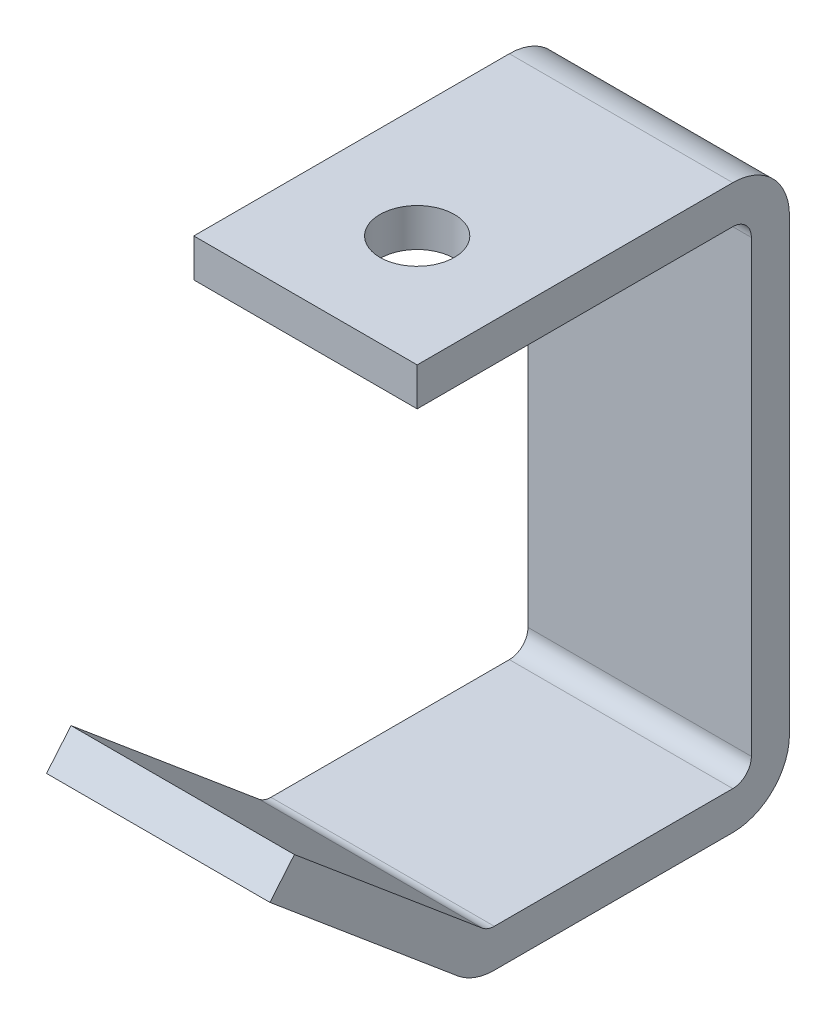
ISO-10303-21;
HEADER;
FILE_DESCRIPTION(('STEP AP214'),'2;1');
FILE_NAME('part.step','',(''),(''),'','','');
FILE_SCHEMA(('AUTOMOTIVE_DESIGN { 1 0 10303 214 1 1 1 1 }'));
ENDSEC;
DATA;
#1=APPLICATION_CONTEXT('core data for automotive mechanical design processes');
#2=APPLICATION_PROTOCOL_DEFINITION('international standard','automotive_design',2000,#1);
#3=PRODUCT_CONTEXT('',#1,'mechanical');
#4=PRODUCT('Part','Part','',(#3));
#5=PRODUCT_RELATED_PRODUCT_CATEGORY('part','',(#4));
#6=PRODUCT_DEFINITION_FORMATION('','',#4);
#7=PRODUCT_DEFINITION_CONTEXT('part definition',#1,'design');
#8=PRODUCT_DEFINITION('design','',#6,#7);
#9=PRODUCT_DEFINITION_SHAPE('','',#8);
#10=(LENGTH_UNIT() NAMED_UNIT(*) SI_UNIT(.MILLI.,.METRE.));
#11=(NAMED_UNIT(*) PLANE_ANGLE_UNIT() SI_UNIT($,.RADIAN.));
#12=(NAMED_UNIT(*) SI_UNIT($,.STERADIAN.) SOLID_ANGLE_UNIT());
#13=UNCERTAINTY_MEASURE_WITH_UNIT(LENGTH_MEASURE(1.E-05),#10,'distance_accuracy_value','');
#14=(GEOMETRIC_REPRESENTATION_CONTEXT(3) GLOBAL_UNCERTAINTY_ASSIGNED_CONTEXT((#13)) GLOBAL_UNIT_ASSIGNED_CONTEXT((#10,
#11,#12)) REPRESENTATION_CONTEXT('',''));
#15=CARTESIAN_POINT('',(0.,0.,0.));
#16=DIRECTION('',(0.,0.,1.));
#17=DIRECTION('',(1.,0.,0.));
#18=AXIS2_PLACEMENT_3D('',#15,#16,#17);
#19=CARTESIAN_POINT('',(19.05,89.5,3.175));
#20=DIRECTION('',(0.,-1.,0.));
#21=DIRECTION('',(0.,0.,-1.));
#22=AXIS2_PLACEMENT_3D('',#19,#20,#21);
#23=PLANE('',#22);
#24=CARTESIAN_POINT('',(0.,89.5,37.95));
#25=DIRECTION('',(0.,1.,0.));
#26=DIRECTION('',(0.,0.,1.));
#27=AXIS2_PLACEMENT_3D('',#24,#25,#26);
#28=CIRCLE('',#27,6.35);
#29=CARTESIAN_POINT('',(0.,89.5,44.3));
#30=VERTEX_POINT('',#29);
#31=EDGE_CURVE('E184',#30,#30,#28,.T.);
#32=ORIENTED_EDGE('',*,*,#31,.F.);
#33=EDGE_LOOP('',(#32));
#34=FACE_BOUND('',#33,.T.);
#35=DIRECTION('',(0.,0.,1.));
#36=VECTOR('',#35,1.);
#37=CARTESIAN_POINT('',(-19.05,89.5,3.175));
#38=LINE('',#37,#36);
#39=CARTESIAN_POINT('',(-19.05,89.5,3.175));
#40=VERTEX_POINT('',#39);
#41=CARTESIAN_POINT('',(-19.05,89.5,57.));
#42=VERTEX_POINT('',#41);
#43=EDGE_CURVE('E180',#40,#42,#38,.T.);
#44=ORIENTED_EDGE('',*,*,#43,.T.);
#45=DIRECTION('',(-1.,0.,0.));
#46=VECTOR('',#45,1.);
#47=CARTESIAN_POINT('',(19.05,89.5,57.));
#48=LINE('',#47,#46);
#49=CARTESIAN_POINT('',(19.05,89.5,57.));
#50=VERTEX_POINT('',#49);
#51=EDGE_CURVE('E11',#50,#42,#48,.T.);
#52=ORIENTED_EDGE('',*,*,#51,.F.);
#53=DIRECTION('',(0.,0.,1.));
#54=VECTOR('',#53,1.);
#55=CARTESIAN_POINT('',(19.05,89.5,3.175));
#56=LINE('',#55,#54);
#57=CARTESIAN_POINT('',(19.05,89.5,3.175));
#58=VERTEX_POINT('',#57);
#59=EDGE_CURVE('E117',#58,#50,#56,.T.);
#60=ORIENTED_EDGE('',*,*,#59,.F.);
#61=DIRECTION('',(-1.,0.,0.));
#62=VECTOR('',#61,1.);
#63=CARTESIAN_POINT('',(19.05,89.5,3.175));
#64=LINE('',#63,#62);
#65=EDGE_CURVE('E176',#58,#40,#64,.T.);
#66=ORIENTED_EDGE('',*,*,#65,.T.);
#67=EDGE_LOOP('',(#44,#52,#60,#66));
#68=FACE_BOUND('',#67,.T.);
#69=ADVANCED_FACE('F37',(#34,#68),#23,.F.);
#70=CARTESIAN_POINT('',(19.05,83.,57.));
#71=DIRECTION('',(0.,0.,1.));
#72=DIRECTION('',(0.,-1.,0.));
#73=AXIS2_PLACEMENT_3D('',#70,#71,#72);
#74=PLANE('',#73);
#75=DIRECTION('',(0.,1.,0.));
#76=VECTOR('',#75,1.);
#77=CARTESIAN_POINT('',(-19.05,83.,57.));
#78=LINE('',#77,#76);
#79=CARTESIAN_POINT('',(-19.05,83.,57.));
#80=VERTEX_POINT('',#79);
#81=EDGE_CURVE('E183',#80,#42,#78,.T.);
#82=ORIENTED_EDGE('',*,*,#81,.F.);
#83=DIRECTION('',(-1.,0.,0.));
#84=VECTOR('',#83,1.);
#85=CARTESIAN_POINT('',(19.05,83.,57.));
#86=LINE('',#85,#84);
#87=CARTESIAN_POINT('',(19.05,83.,57.));
#88=VERTEX_POINT('',#87);
#89=EDGE_CURVE('E45',#88,#80,#86,.T.);
#90=ORIENTED_EDGE('',*,*,#89,.F.);
#91=DIRECTION('',(0.,1.,0.));
#92=VECTOR('',#91,1.);
#93=CARTESIAN_POINT('',(19.05,83.,57.));
#94=LINE('',#93,#92);
#95=EDGE_CURVE('E266',#88,#50,#94,.T.);
#96=ORIENTED_EDGE('',*,*,#95,.T.);
#97=ORIENTED_EDGE('',*,*,#51,.T.);
#98=EDGE_LOOP('',(#82,#90,#96,#97));
#99=FACE_BOUND('',#98,.T.);
#100=ADVANCED_FACE('F253',(#99),#74,.T.);
#101=CARTESIAN_POINT('',(19.05,83.,3.175));
#102=DIRECTION('',(0.,-1.,0.));
#103=DIRECTION('',(0.,0.,-1.));
#104=AXIS2_PLACEMENT_3D('',#101,#102,#103);
#105=PLANE('',#104);
#106=CARTESIAN_POINT('',(0.,83.,37.95));
#107=DIRECTION('',(0.,-1.,0.));
#108=DIRECTION('',(0.,0.,-1.));
#109=AXIS2_PLACEMENT_3D('',#106,#107,#108);
#110=CIRCLE('',#109,6.35);
#111=CARTESIAN_POINT('',(0.,83.,44.3));
#112=VERTEX_POINT('',#111);
#113=EDGE_CURVE('E324',#112,#112,#110,.F.);
#114=ORIENTED_EDGE('',*,*,#113,.T.);
#115=EDGE_LOOP('',(#114));
#116=FACE_BOUND('',#115,.T.);
#117=DIRECTION('',(0.,0.,1.));
#118=VECTOR('',#117,1.);
#119=CARTESIAN_POINT('',(-19.05,83.,3.175));
#120=LINE('',#119,#118);
#121=CARTESIAN_POINT('',(-19.05,83.,3.175));
#122=VERTEX_POINT('',#121);
#123=EDGE_CURVE('E187',#122,#80,#120,.T.);
#124=ORIENTED_EDGE('',*,*,#123,.F.);
#125=DIRECTION('',(-1.,0.,0.));
#126=VECTOR('',#125,1.);
#127=CARTESIAN_POINT('',(19.05,83.,3.175));
#128=LINE('',#127,#126);
#129=CARTESIAN_POINT('',(19.05,83.,3.175));
#130=VERTEX_POINT('',#129);
#131=EDGE_CURVE('E243',#130,#122,#128,.T.);
#132=ORIENTED_EDGE('',*,*,#131,.F.);
#133=DIRECTION('',(0.,0.,1.));
#134=VECTOR('',#133,1.);
#135=CARTESIAN_POINT('',(19.05,83.,3.175));
#136=LINE('',#135,#134);
#137=EDGE_CURVE('E250',#130,#88,#136,.T.);
#138=ORIENTED_EDGE('',*,*,#137,.T.);
#139=ORIENTED_EDGE('',*,*,#89,.T.);
#140=EDGE_LOOP('',(#124,#132,#138,#139));
#141=FACE_BOUND('',#140,.T.);
#142=ADVANCED_FACE('F248',(#116,#141),#105,.T.);
#143=CARTESIAN_POINT('',(19.05,79.825,3.175));
#144=DIRECTION('',(-1.,0.,0.));
#145=DIRECTION('',(0.,0.,1.));
#146=AXIS2_PLACEMENT_3D('',#143,#144,#145);
#147=CYLINDRICAL_SURFACE('',#146,3.175);
#148=CARTESIAN_POINT('',(-19.05,79.825,3.175));
#149=DIRECTION('',(1.,0.,0.));
#150=DIRECTION('',(0.,0.,-1.));
#151=AXIS2_PLACEMENT_3D('',#148,#149,#150);
#152=CIRCLE('',#151,3.175);
#153=CARTESIAN_POINT('',(-19.05,79.825,0.));
#154=VERTEX_POINT('',#153);
#155=EDGE_CURVE('E190',#154,#122,#152,.T.);
#156=ORIENTED_EDGE('',*,*,#155,.F.);
#157=DIRECTION('',(-1.,0.,0.));
#158=VECTOR('',#157,1.);
#159=CARTESIAN_POINT('',(19.05,79.825,0.));
#160=LINE('',#159,#158);
#161=CARTESIAN_POINT('',(19.05,79.825,0.));
#162=VERTEX_POINT('',#161);
#163=EDGE_CURVE('E241',#162,#154,#160,.T.);
#164=ORIENTED_EDGE('',*,*,#163,.F.);
#165=CARTESIAN_POINT('',(19.05,79.825,3.175));
#166=DIRECTION('',(1.,0.,0.));
#167=DIRECTION('',(0.,0.,-1.));
#168=AXIS2_PLACEMENT_3D('',#165,#166,#167);
#169=CIRCLE('',#168,3.175);
#170=EDGE_CURVE('E263',#162,#130,#169,.T.);
#171=ORIENTED_EDGE('',*,*,#170,.T.);
#172=ORIENTED_EDGE('',*,*,#131,.T.);
#173=EDGE_LOOP('',(#156,#164,#171,#172));
#174=FACE_BOUND('',#173,.T.);
#175=ADVANCED_FACE('F260',(#174),#147,.F.);
#176=CARTESIAN_POINT('',(19.05,3.175,0.));
#177=DIRECTION('',(0.,0.,1.));
#178=DIRECTION('',(1.,0.,0.));
#179=AXIS2_PLACEMENT_3D('',#176,#177,#178);
#180=PLANE('',#179);
#181=DIRECTION('',(0.,1.,0.));
#182=VECTOR('',#181,1.);
#183=CARTESIAN_POINT('',(-19.05,3.175,0.));
#184=LINE('',#183,#182);
#185=CARTESIAN_POINT('',(-19.05,3.175,0.));
#186=VERTEX_POINT('',#185);
#187=EDGE_CURVE('E193',#186,#154,#184,.T.);
#188=ORIENTED_EDGE('',*,*,#187,.F.);
#189=DIRECTION('',(-1.,0.,0.));
#190=VECTOR('',#189,1.);
#191=CARTESIAN_POINT('',(19.05,3.175,0.));
#192=LINE('',#191,#190);
#193=CARTESIAN_POINT('',(19.05,3.175,0.));
#194=VERTEX_POINT('',#193);
#195=EDGE_CURVE('E239',#194,#186,#192,.T.);
#196=ORIENTED_EDGE('',*,*,#195,.F.);
#197=DIRECTION('',(0.,1.,0.));
#198=VECTOR('',#197,1.);
#199=CARTESIAN_POINT('',(19.05,3.175,0.));
#200=LINE('',#199,#198);
#201=EDGE_CURVE('E268',#194,#162,#200,.T.);
#202=ORIENTED_EDGE('',*,*,#201,.T.);
#203=ORIENTED_EDGE('',*,*,#163,.T.);
#204=EDGE_LOOP('',(#188,#196,#202,#203));
#205=FACE_BOUND('',#204,.T.);
#206=ADVANCED_FACE('F414',(#205),#180,.T.);
#207=CARTESIAN_POINT('',(19.05,3.175,3.175));
#208=DIRECTION('',(-1.,0.,0.));
#209=DIRECTION('',(0.,0.,1.));
#210=AXIS2_PLACEMENT_3D('',#207,#208,#209);
#211=CYLINDRICAL_SURFACE('',#210,3.175);
#212=CARTESIAN_POINT('',(-19.05,3.175,3.175));
#213=DIRECTION('',(1.,0.,0.));
#214=DIRECTION('',(0.,0.,1.));
#215=AXIS2_PLACEMENT_3D('',#212,#213,#214);
#216=CIRCLE('',#215,3.175);
#217=CARTESIAN_POINT('',(-19.05,0.,3.175));
#218=VERTEX_POINT('',#217);
#219=EDGE_CURVE('E196',#218,#186,#216,.T.);
#220=ORIENTED_EDGE('',*,*,#219,.F.);
#221=DIRECTION('',(-1.,0.,0.));
#222=VECTOR('',#221,1.);
#223=CARTESIAN_POINT('',(19.05,0.,3.175));
#224=LINE('',#223,#222);
#225=CARTESIAN_POINT('',(19.05,0.,3.175));
#226=VERTEX_POINT('',#225);
#227=EDGE_CURVE('E237',#226,#218,#224,.T.);
#228=ORIENTED_EDGE('',*,*,#227,.F.);
#229=CARTESIAN_POINT('',(19.05,3.175,3.175));
#230=DIRECTION('',(1.,0.,0.));
#231=DIRECTION('',(0.,0.,1.));
#232=AXIS2_PLACEMENT_3D('',#229,#230,#231);
#233=CIRCLE('',#232,3.175);
#234=EDGE_CURVE('E274',#226,#194,#233,.T.);
#235=ORIENTED_EDGE('',*,*,#234,.T.);
#236=ORIENTED_EDGE('',*,*,#195,.T.);
#237=EDGE_LOOP('',(#220,#228,#235,#236));
#238=FACE_BOUND('',#237,.T.);
#239=ADVANCED_FACE('F406',(#238),#211,.F.);
#240=CARTESIAN_POINT('',(19.05,0.,43.8443945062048));
#241=DIRECTION('',(0.,1.,0.));
#242=DIRECTION('',(0.,0.,1.));
#243=AXIS2_PLACEMENT_3D('',#240,#241,#242);
#244=PLANE('',#243);
#245=DIRECTION('',(0.,0.,-1.));
#246=VECTOR('',#245,1.);
#247=CARTESIAN_POINT('',(-19.05,0.,43.8443945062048));
#248=LINE('',#247,#246);
#249=CARTESIAN_POINT('',(-19.05,0.,43.8443945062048));
#250=VERTEX_POINT('',#249);
#251=EDGE_CURVE('E199',#250,#218,#248,.T.);
#252=ORIENTED_EDGE('',*,*,#251,.F.);
#253=DIRECTION('',(-1.,0.,0.));
#254=VECTOR('',#253,1.);
#255=CARTESIAN_POINT('',(19.05,0.,43.8443945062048));
#256=LINE('',#255,#254);
#257=CARTESIAN_POINT('',(19.05,0.,43.8443945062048));
#258=VERTEX_POINT('',#257);
#259=EDGE_CURVE('E235',#258,#250,#256,.T.);
#260=ORIENTED_EDGE('',*,*,#259,.F.);
#261=DIRECTION('',(0.,0.,-1.));
#262=VECTOR('',#261,1.);
#263=CARTESIAN_POINT('',(19.05,0.,43.8443945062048));
#264=LINE('',#263,#262);
#265=EDGE_CURVE('E277',#258,#226,#264,.T.);
#266=ORIENTED_EDGE('',*,*,#265,.T.);
#267=ORIENTED_EDGE('',*,*,#227,.T.);
#268=EDGE_LOOP('',(#252,#260,#266,#267));
#269=FACE_BOUND('',#268,.T.);
#270=ADVANCED_FACE('F398',(#269),#244,.T.);
#271=CARTESIAN_POINT('',(19.05,3.175,43.8443945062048));
#272=DIRECTION('',(-1.,0.,0.));
#273=DIRECTION('',(0.,0.,1.));
#274=AXIS2_PLACEMENT_3D('',#271,#272,#273);
#275=CYLINDRICAL_SURFACE('',#274,3.175);
#276=CARTESIAN_POINT('',(-19.05,3.175,43.8443945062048));
#277=DIRECTION('',(1.,0.,0.));
#278=DIRECTION('',(0.,0.,-1.));
#279=AXIS2_PLACEMENT_3D('',#276,#277,#278);
#280=CIRCLE('',#279,3.175);
#281=CARTESIAN_POINT('',(-19.05,0.742808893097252,45.8852451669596));
#282=VERTEX_POINT('',#281);
#283=EDGE_CURVE('E202',#282,#250,#280,.T.);
#284=ORIENTED_EDGE('',*,*,#283,.F.);
#285=DIRECTION('',(-1.,0.,0.));
#286=VECTOR('',#285,1.);
#287=CARTESIAN_POINT('',(19.05,0.742808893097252,45.8852451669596));
#288=LINE('',#287,#286);
#289=CARTESIAN_POINT('',(19.05,0.742808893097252,45.8852451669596));
#290=VERTEX_POINT('',#289);
#291=EDGE_CURVE('E233',#290,#282,#288,.T.);
#292=ORIENTED_EDGE('',*,*,#291,.F.);
#293=CARTESIAN_POINT('',(19.05,3.175,43.8443945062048));
#294=DIRECTION('',(1.,0.,0.));
#295=DIRECTION('',(0.,0.,-1.));
#296=AXIS2_PLACEMENT_3D('',#293,#294,#295);
#297=CIRCLE('',#296,3.175);
#298=EDGE_CURVE('E280',#290,#258,#297,.T.);
#299=ORIENTED_EDGE('',*,*,#298,.T.);
#300=ORIENTED_EDGE('',*,*,#259,.T.);
#301=EDGE_LOOP('',(#284,#292,#299,#300));
#302=FACE_BOUND('',#301,.T.);
#303=ADVANCED_FACE('F390',(#302),#275,.F.);
#304=CARTESIAN_POINT('',(19.05,27.6398672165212,77.939911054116));
#305=DIRECTION('',(0.,0.766044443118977,-0.642787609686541));
#306=DIRECTION('',(0.,0.642787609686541,0.766044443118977));
#307=AXIS2_PLACEMENT_3D('',#304,#305,#306);
#308=PLANE('',#307);
#309=DIRECTION('',(0.,-0.642787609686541,-0.766044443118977));
#310=VECTOR('',#309,1.);
#311=CARTESIAN_POINT('',(-19.05,27.6398672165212,77.939911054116));
#312=LINE('',#311,#310);
#313=CARTESIAN_POINT('',(-19.05,27.6398672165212,77.939911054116));
#314=VERTEX_POINT('',#313);
#315=EDGE_CURVE('E205',#314,#282,#312,.T.);
#316=ORIENTED_EDGE('',*,*,#315,.F.);
#317=DIRECTION('',(-1.,0.,0.));
#318=VECTOR('',#317,1.);
#319=CARTESIAN_POINT('',(19.05,27.6398672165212,77.939911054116));
#320=LINE('',#319,#318);
#321=CARTESIAN_POINT('',(19.05,27.6398672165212,77.939911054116));
#322=VERTEX_POINT('',#321);
#323=EDGE_CURVE('E231',#322,#314,#320,.T.);
#324=ORIENTED_EDGE('',*,*,#323,.F.);
#325=DIRECTION('',(0.,-0.642787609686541,-0.766044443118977));
#326=VECTOR('',#325,1.);
#327=CARTESIAN_POINT('',(19.05,27.6398672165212,77.939911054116));
#328=LINE('',#327,#326);
#329=EDGE_CURVE('E283',#322,#290,#328,.T.);
#330=ORIENTED_EDGE('',*,*,#329,.T.);
#331=ORIENTED_EDGE('',*,*,#291,.T.);
#332=EDGE_LOOP('',(#316,#324,#330,#331));
#333=FACE_BOUND('',#332,.T.);
#334=ADVANCED_FACE('F382',(#333),#308,.T.);
#335=CARTESIAN_POINT('',(19.05,22.6605783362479,82.1180305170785));
#336=DIRECTION('',(0.,0.64278760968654,0.766044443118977));
#337=DIRECTION('',(0.,-0.766044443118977,0.64278760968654));
#338=AXIS2_PLACEMENT_3D('',#335,#336,#337);
#339=PLANE('',#338);
#340=DIRECTION('',(0.,0.766044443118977,-0.64278760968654));
#341=VECTOR('',#340,1.);
#342=CARTESIAN_POINT('',(-19.05,22.6605783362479,82.1180305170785));
#343=LINE('',#342,#341);
#344=CARTESIAN_POINT('',(-19.05,22.6605783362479,82.1180305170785));
#345=VERTEX_POINT('',#344);
#346=EDGE_CURVE('E208',#345,#314,#343,.T.);
#347=ORIENTED_EDGE('',*,*,#346,.F.);
#348=DIRECTION('',(-1.,0.,0.));
#349=VECTOR('',#348,1.);
#350=CARTESIAN_POINT('',(19.05,22.6605783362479,82.1180305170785));
#351=LINE('',#350,#349);
#352=CARTESIAN_POINT('',(19.05,22.6605783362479,82.1180305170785));
#353=VERTEX_POINT('',#352);
#354=EDGE_CURVE('E229',#353,#345,#351,.T.);
#355=ORIENTED_EDGE('',*,*,#354,.F.);
#356=DIRECTION('',(0.,0.766044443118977,-0.64278760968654));
#357=VECTOR('',#356,1.);
#358=CARTESIAN_POINT('',(19.05,22.6605783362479,82.1180305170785));
#359=LINE('',#358,#357);
#360=EDGE_CURVE('E286',#353,#322,#359,.T.);
#361=ORIENTED_EDGE('',*,*,#360,.T.);
#362=ORIENTED_EDGE('',*,*,#323,.T.);
#363=EDGE_LOOP('',(#347,#355,#361,#362));
#364=FACE_BOUND('',#363,.T.);
#365=ADVANCED_FACE('F374',(#364),#339,.T.);
#366=CARTESIAN_POINT('',(19.05,22.6605783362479,82.1180305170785));
#367=DIRECTION('',(0.,0.766044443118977,-0.642787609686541));
#368=DIRECTION('',(0.,0.642787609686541,0.766044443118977));
#369=AXIS2_PLACEMENT_3D('',#366,#367,#368);
#370=PLANE('',#369);
#371=DIRECTION('',(0.,-0.642787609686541,-0.766044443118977));
#372=VECTOR('',#371,1.);
#373=CARTESIAN_POINT('',(-19.05,22.6605783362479,82.1180305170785));
#374=LINE('',#373,#372);
#375=CARTESIAN_POINT('',(-19.05,-4.23647998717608,50.0633646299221));
#376=VERTEX_POINT('',#375);
#377=EDGE_CURVE('E211',#345,#376,#374,.T.);
#378=ORIENTED_EDGE('',*,*,#377,.T.);
#379=DIRECTION('',(-1.,0.,0.));
#380=VECTOR('',#379,1.);
#381=CARTESIAN_POINT('',(19.05,-4.23647998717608,50.0633646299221));
#382=LINE('',#381,#380);
#383=CARTESIAN_POINT('',(19.05,-4.23647998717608,50.0633646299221));
#384=VERTEX_POINT('',#383);
#385=EDGE_CURVE('E226',#384,#376,#382,.T.);
#386=ORIENTED_EDGE('',*,*,#385,.F.);
#387=DIRECTION('',(0.,-0.642787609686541,-0.766044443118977));
#388=VECTOR('',#387,1.);
#389=CARTESIAN_POINT('',(19.05,22.6605783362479,82.1180305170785));
#390=LINE('',#389,#388);
#391=EDGE_CURVE('E289',#353,#384,#390,.T.);
#392=ORIENTED_EDGE('',*,*,#391,.F.);
#393=ORIENTED_EDGE('',*,*,#354,.T.);
#394=EDGE_LOOP('',(#378,#386,#392,#393));
#395=FACE_BOUND('',#394,.T.);
#396=ADVANCED_FACE('F367',(#395),#370,.F.);
#397=CARTESIAN_POINT('',(19.05,3.175,43.8443945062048));
#398=DIRECTION('',(-1.,0.,0.));
#399=DIRECTION('',(0.,0.,1.));
#400=AXIS2_PLACEMENT_3D('',#397,#398,#399);
#401=CYLINDRICAL_SURFACE('',#400,9.675);
#402=CARTESIAN_POINT('',(-19.05,3.175,43.8443945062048));
#403=DIRECTION('',(1.,0.,0.));
#404=DIRECTION('',(0.,0.,-1.));
#405=AXIS2_PLACEMENT_3D('',#402,#403,#404);
#406=CIRCLE('',#405,9.675);
#407=CARTESIAN_POINT('',(-19.05,-6.5,43.8443945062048));
#408=VERTEX_POINT('',#407);
#409=EDGE_CURVE('E213',#376,#408,#406,.T.);
#410=ORIENTED_EDGE('',*,*,#409,.T.);
#411=DIRECTION('',(-1.,0.,0.));
#412=VECTOR('',#411,1.);
#413=CARTESIAN_POINT('',(19.05,-6.5,43.8443945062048));
#414=LINE('',#413,#412);
#415=CARTESIAN_POINT('',(19.05,-6.5,43.8443945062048));
#416=VERTEX_POINT('',#415);
#417=EDGE_CURVE('E223',#416,#408,#414,.T.);
#418=ORIENTED_EDGE('',*,*,#417,.F.);
#419=CARTESIAN_POINT('',(19.05,3.175,43.8443945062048));
#420=DIRECTION('',(1.,0.,0.));
#421=DIRECTION('',(0.,0.,-1.));
#422=AXIS2_PLACEMENT_3D('',#419,#420,#421);
#423=CIRCLE('',#422,9.675);
#424=EDGE_CURVE('E291',#384,#416,#423,.T.);
#425=ORIENTED_EDGE('',*,*,#424,.F.);
#426=ORIENTED_EDGE('',*,*,#385,.T.);
#427=EDGE_LOOP('',(#410,#418,#425,#426));
#428=FACE_BOUND('',#427,.T.);
#429=ADVANCED_FACE('F298',(#428),#401,.T.);
#430=CARTESIAN_POINT('',(19.05,-6.5,43.8443945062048));
#431=DIRECTION('',(0.,1.,0.));
#432=DIRECTION('',(0.,0.,1.));
#433=AXIS2_PLACEMENT_3D('',#430,#431,#432);
#434=PLANE('',#433);
#435=DIRECTION('',(0.,0.,-1.));
#436=VECTOR('',#435,1.);
#437=CARTESIAN_POINT('',(-19.05,-6.5,43.8443945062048));
#438=LINE('',#437,#436);
#439=CARTESIAN_POINT('',(-19.05,-6.5,3.17499999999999));
#440=VERTEX_POINT('',#439);
#441=EDGE_CURVE('E215',#408,#440,#438,.T.);
#442=ORIENTED_EDGE('',*,*,#441,.T.);
#443=DIRECTION('',(-1.,0.,0.));
#444=VECTOR('',#443,1.);
#445=CARTESIAN_POINT('',(19.05,-6.5,3.17499999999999));
#446=LINE('',#445,#444);
#447=CARTESIAN_POINT('',(19.05,-6.5,3.17499999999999));
#448=VERTEX_POINT('',#447);
#449=EDGE_CURVE('E171',#448,#440,#446,.T.);
#450=ORIENTED_EDGE('',*,*,#449,.F.);
#451=DIRECTION('',(0.,0.,-1.));
#452=VECTOR('',#451,1.);
#453=CARTESIAN_POINT('',(19.05,-6.5,43.8443945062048));
#454=LINE('',#453,#452);
#455=EDGE_CURVE('E162',#416,#448,#454,.T.);
#456=ORIENTED_EDGE('',*,*,#455,.F.);
#457=ORIENTED_EDGE('',*,*,#417,.T.);
#458=EDGE_LOOP('',(#442,#450,#456,#457));
#459=FACE_BOUND('',#458,.T.);
#460=ADVANCED_FACE('F302',(#459),#434,.F.);
#461=CARTESIAN_POINT('',(19.05,3.175,3.175));
#462=DIRECTION('',(-1.,0.,0.));
#463=DIRECTION('',(0.,0.,1.));
#464=AXIS2_PLACEMENT_3D('',#461,#462,#463);
#465=CYLINDRICAL_SURFACE('',#464,9.675);
#466=CARTESIAN_POINT('',(-19.05,3.175,3.175));
#467=DIRECTION('',(1.,0.,0.));
#468=DIRECTION('',(0.,0.,-1.));
#469=AXIS2_PLACEMENT_3D('',#466,#467,#468);
#470=CIRCLE('',#469,9.675);
#471=CARTESIAN_POINT('',(-19.05,3.175,-6.5));
#472=VERTEX_POINT('',#471);
#473=EDGE_CURVE('E170',#440,#472,#470,.T.);
#474=ORIENTED_EDGE('',*,*,#473,.T.);
#475=DIRECTION('',(-1.,0.,0.));
#476=VECTOR('',#475,1.);
#477=CARTESIAN_POINT('',(19.05,3.175,-6.5));
#478=LINE('',#477,#476);
#479=CARTESIAN_POINT('',(19.05,3.175,-6.5));
#480=VERTEX_POINT('',#479);
#481=EDGE_CURVE('E167',#480,#472,#478,.T.);
#482=ORIENTED_EDGE('',*,*,#481,.F.);
#483=CARTESIAN_POINT('',(19.05,3.175,3.175));
#484=DIRECTION('',(1.,0.,0.));
#485=DIRECTION('',(0.,0.,-1.));
#486=AXIS2_PLACEMENT_3D('',#483,#484,#485);
#487=CIRCLE('',#486,9.675);
#488=EDGE_CURVE('E156',#448,#480,#487,.T.);
#489=ORIENTED_EDGE('',*,*,#488,.F.);
#490=ORIENTED_EDGE('',*,*,#449,.T.);
#491=EDGE_LOOP('',(#474,#482,#489,#490));
#492=FACE_BOUND('',#491,.T.);
#493=ADVANCED_FACE('F168',(#492),#465,.T.);
#494=CARTESIAN_POINT('',(19.05,3.175,-6.5));
#495=DIRECTION('',(0.,0.,1.));
#496=DIRECTION('',(1.,0.,0.));
#497=AXIS2_PLACEMENT_3D('',#494,#495,#496);
#498=PLANE('',#497);
#499=DIRECTION('',(0.,1.,0.));
#500=VECTOR('',#499,1.);
#501=CARTESIAN_POINT('',(-19.05,3.175,-6.5));
#502=LINE('',#501,#500);
#503=CARTESIAN_POINT('',(-19.05,79.825,-6.5));
#504=VERTEX_POINT('',#503);
#505=EDGE_CURVE('E105',#472,#504,#502,.T.);
#506=ORIENTED_EDGE('',*,*,#505,.T.);
#507=DIRECTION('',(-1.,0.,0.));
#508=VECTOR('',#507,1.);
#509=CARTESIAN_POINT('',(19.05,79.825,-6.5));
#510=LINE('',#509,#508);
#511=CARTESIAN_POINT('',(19.05,79.825,-6.5));
#512=VERTEX_POINT('',#511);
#513=EDGE_CURVE('E172',#512,#504,#510,.T.);
#514=ORIENTED_EDGE('',*,*,#513,.F.);
#515=DIRECTION('',(0.,1.,0.));
#516=VECTOR('',#515,1.);
#517=CARTESIAN_POINT('',(19.05,3.175,-6.5));
#518=LINE('',#517,#516);
#519=EDGE_CURVE('E160',#480,#512,#518,.T.);
#520=ORIENTED_EDGE('',*,*,#519,.F.);
#521=ORIENTED_EDGE('',*,*,#481,.T.);
#522=EDGE_LOOP('',(#506,#514,#520,#521));
#523=FACE_BOUND('',#522,.T.);
#524=ADVANCED_FACE('F174',(#523),#498,.F.);
#525=CARTESIAN_POINT('',(19.05,79.825,3.175));
#526=DIRECTION('',(-1.,0.,0.));
#527=DIRECTION('',(0.,0.,1.));
#528=AXIS2_PLACEMENT_3D('',#525,#526,#527);
#529=CYLINDRICAL_SURFACE('',#528,9.675);
#530=CARTESIAN_POINT('',(-19.05,79.825,3.175));
#531=DIRECTION('',(1.,0.,0.));
#532=DIRECTION('',(0.,0.,-1.));
#533=AXIS2_PLACEMENT_3D('',#530,#531,#532);
#534=CIRCLE('',#533,9.675);
#535=EDGE_CURVE('E111',#504,#40,#534,.T.);
#536=ORIENTED_EDGE('',*,*,#535,.T.);
#537=ORIENTED_EDGE('',*,*,#65,.F.);
#538=CARTESIAN_POINT('',(19.05,79.825,3.175));
#539=DIRECTION('',(1.,0.,0.));
#540=DIRECTION('',(0.,0.,-1.));
#541=AXIS2_PLACEMENT_3D('',#538,#539,#540);
#542=CIRCLE('',#541,9.675);
#543=EDGE_CURVE('E53',#512,#58,#542,.T.);
#544=ORIENTED_EDGE('',*,*,#543,.F.);
#545=ORIENTED_EDGE('',*,*,#513,.T.);
#546=EDGE_LOOP('',(#536,#537,#544,#545));
#547=FACE_BOUND('',#546,.T.);
#548=ADVANCED_FACE('F304',(#547),#529,.T.);
#549=CARTESIAN_POINT('',(19.05,79.825,3.175));
#550=DIRECTION('',(1.,0.,0.));
#551=DIRECTION('',(0.,0.,-1.));
#552=AXIS2_PLACEMENT_3D('',#549,#550,#551);
#553=PLANE('',#552);
#554=ORIENTED_EDGE('',*,*,#59,.T.);
#555=ORIENTED_EDGE('',*,*,#95,.F.);
#556=ORIENTED_EDGE('',*,*,#137,.F.);
#557=ORIENTED_EDGE('',*,*,#170,.F.);
#558=ORIENTED_EDGE('',*,*,#201,.F.);
#559=ORIENTED_EDGE('',*,*,#234,.F.);
#560=ORIENTED_EDGE('',*,*,#265,.F.);
#561=ORIENTED_EDGE('',*,*,#298,.F.);
#562=ORIENTED_EDGE('',*,*,#329,.F.);
#563=ORIENTED_EDGE('',*,*,#360,.F.);
#564=ORIENTED_EDGE('',*,*,#391,.T.);
#565=ORIENTED_EDGE('',*,*,#424,.T.);
#566=ORIENTED_EDGE('',*,*,#455,.T.);
#567=ORIENTED_EDGE('',*,*,#488,.T.);
#568=ORIENTED_EDGE('',*,*,#519,.T.);
#569=ORIENTED_EDGE('',*,*,#543,.T.);
#570=EDGE_LOOP('',(#554,#555,#556,#557,#558,#559,#560,#561,#562,#563,#564,#565,#566,#567,#568,#569));
#571=FACE_BOUND('',#570,.T.);
#572=ADVANCED_FACE('F158',(#571),#553,.T.);
#573=CARTESIAN_POINT('',(-19.05,79.825,3.175));
#574=DIRECTION('',(1.,0.,0.));
#575=DIRECTION('',(0.,0.,-1.));
#576=AXIS2_PLACEMENT_3D('',#573,#574,#575);
#577=PLANE('',#576);
#578=ORIENTED_EDGE('',*,*,#43,.F.);
#579=ORIENTED_EDGE('',*,*,#535,.F.);
#580=ORIENTED_EDGE('',*,*,#505,.F.);
#581=ORIENTED_EDGE('',*,*,#473,.F.);
#582=ORIENTED_EDGE('',*,*,#441,.F.);
#583=ORIENTED_EDGE('',*,*,#409,.F.);
#584=ORIENTED_EDGE('',*,*,#377,.F.);
#585=ORIENTED_EDGE('',*,*,#346,.T.);
#586=ORIENTED_EDGE('',*,*,#315,.T.);
#587=ORIENTED_EDGE('',*,*,#283,.T.);
#588=ORIENTED_EDGE('',*,*,#251,.T.);
#589=ORIENTED_EDGE('',*,*,#219,.T.);
#590=ORIENTED_EDGE('',*,*,#187,.T.);
#591=ORIENTED_EDGE('',*,*,#155,.T.);
#592=ORIENTED_EDGE('',*,*,#123,.T.);
#593=ORIENTED_EDGE('',*,*,#81,.T.);
#594=EDGE_LOOP('',(#578,#579,#580,#581,#582,#583,#584,#585,#586,#587,#588,#589,#590,#591,#592,#593));
#595=FACE_BOUND('',#594,.T.);
#596=ADVANCED_FACE('F256',(#595),#577,.F.);
#597=CARTESIAN_POINT('',(0.,-6.50100000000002,37.9500000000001));
#598=DIRECTION('',(0.,1.,0.));
#599=DIRECTION('',(0.,0.,1.));
#600=AXIS2_PLACEMENT_3D('',#597,#598,#599);
#601=CYLINDRICAL_SURFACE('',#600,6.35);
#602=CARTESIAN_POINT('',(0.,83.,44.3));
#603=CARTESIAN_POINT('',(0.,83.0677083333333,44.3));
#604=CARTESIAN_POINT('',(0.,83.1354166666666,44.3));
#605=CARTESIAN_POINT('',(0.,83.2708333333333,44.3));
#606=CARTESIAN_POINT('',(0.,83.3385416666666,44.3));
#607=CARTESIAN_POINT('',(0.,83.4739583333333,44.3));
#608=CARTESIAN_POINT('',(0.,83.5416666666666,44.3));
#609=CARTESIAN_POINT('',(0.,83.6770833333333,44.3));
#610=CARTESIAN_POINT('',(0.,83.7447916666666,44.3));
#611=CARTESIAN_POINT('',(0.,83.8802083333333,44.3));
#612=CARTESIAN_POINT('',(0.,83.9479166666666,44.3));
#613=CARTESIAN_POINT('',(0.,84.0833333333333,44.3));
#614=CARTESIAN_POINT('',(0.,84.1510416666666,44.3));
#615=CARTESIAN_POINT('',(0.,84.2864583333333,44.3));
#616=CARTESIAN_POINT('',(0.,84.3541666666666,44.3));
#617=CARTESIAN_POINT('',(0.,84.4895833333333,44.3));
#618=CARTESIAN_POINT('',(0.,84.5572916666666,44.3));
#619=CARTESIAN_POINT('',(0.,84.6927083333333,44.3));
#620=CARTESIAN_POINT('',(0.,84.7604166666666,44.3));
#621=CARTESIAN_POINT('',(0.,84.8958333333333,44.3));
#622=CARTESIAN_POINT('',(0.,84.9635416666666,44.3));
#623=CARTESIAN_POINT('',(0.,85.0989583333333,44.3));
#624=CARTESIAN_POINT('',(0.,85.1666666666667,44.3));
#625=CARTESIAN_POINT('',(0.,85.3020833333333,44.3));
#626=CARTESIAN_POINT('',(0.,85.3697916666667,44.3));
#627=CARTESIAN_POINT('',(0.,85.5052083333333,44.3));
#628=CARTESIAN_POINT('',(0.,85.5729166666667,44.3));
#629=CARTESIAN_POINT('',(0.,85.7083333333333,44.3));
#630=CARTESIAN_POINT('',(0.,85.7760416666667,44.3));
#631=CARTESIAN_POINT('',(0.,85.9114583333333,44.3));
#632=CARTESIAN_POINT('',(0.,85.9791666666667,44.3));
#633=CARTESIAN_POINT('',(0.,86.1145833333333,44.3));
#634=CARTESIAN_POINT('',(0.,86.1822916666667,44.3));
#635=CARTESIAN_POINT('',(0.,86.3177083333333,44.3));
#636=CARTESIAN_POINT('',(0.,86.3854166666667,44.3));
#637=CARTESIAN_POINT('',(0.,86.5208333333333,44.3));
#638=CARTESIAN_POINT('',(0.,86.5885416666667,44.3));
#639=CARTESIAN_POINT('',(0.,86.7239583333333,44.3));
#640=CARTESIAN_POINT('',(0.,86.7916666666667,44.3));
#641=CARTESIAN_POINT('',(0.,86.9270833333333,44.3));
#642=CARTESIAN_POINT('',(0.,86.9947916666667,44.3));
#643=CARTESIAN_POINT('',(0.,87.1302083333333,44.3));
#644=CARTESIAN_POINT('',(0.,87.1979166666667,44.3));
#645=CARTESIAN_POINT('',(0.,87.3333333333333,44.3));
#646=CARTESIAN_POINT('',(0.,87.4010416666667,44.3));
#647=CARTESIAN_POINT('',(0.,87.5364583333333,44.3));
#648=CARTESIAN_POINT('',(0.,87.6041666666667,44.3));
#649=CARTESIAN_POINT('',(0.,87.7395833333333,44.3));
#650=CARTESIAN_POINT('',(0.,87.8072916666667,44.3));
#651=CARTESIAN_POINT('',(0.,87.9427083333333,44.3));
#652=CARTESIAN_POINT('',(0.,88.0104166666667,44.3));
#653=CARTESIAN_POINT('',(0.,88.1458333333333,44.3));
#654=CARTESIAN_POINT('',(0.,88.2135416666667,44.3));
#655=CARTESIAN_POINT('',(0.,88.3489583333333,44.3));
#656=CARTESIAN_POINT('',(0.,88.4166666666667,44.3));
#657=CARTESIAN_POINT('',(0.,88.5520833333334,44.3));
#658=CARTESIAN_POINT('',(0.,88.6197916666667,44.3));
#659=CARTESIAN_POINT('',(0.,88.7552083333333,44.3));
#660=CARTESIAN_POINT('',(0.,88.8229166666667,44.3));
#661=CARTESIAN_POINT('',(0.,88.9583333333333,44.3));
#662=CARTESIAN_POINT('',(0.,89.0260416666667,44.3));
#663=CARTESIAN_POINT('',(0.,89.1614583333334,44.3));
#664=CARTESIAN_POINT('',(0.,89.2291666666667,44.3));
#665=CARTESIAN_POINT('',(0.,89.3645833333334,44.3));
#666=CARTESIAN_POINT('',(0.,89.4322916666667,44.3));
#667=CARTESIAN_POINT('',(0.,89.5,44.3));
#668=B_SPLINE_CURVE_WITH_KNOTS('',3,(#602,#603,#604,#605,#606,#607,#608,#609,#610,#611,#612,
#613,#614,#615,#616,#617,#618,#619,#620,#621,#622,#623,#624,#625,#626,#627,#628,#629,#630,#631,
#632,#633,#634,#635,#636,#637,#638,#639,#640,#641,#642,#643,#644,#645,#646,#647,#648,#649,#650,
#651,#652,#653,#654,#655,#656,#657,#658,#659,#660,#661,#662,#663,#664,#665,#666,#667),
.UNSPECIFIED.,.F.,.F.,(4,2,2,2,2,2,2,2,2,2,2,2,2,2,2,2,2,2,2,2,2,2,2,2,2,2,2,2,2,2,2,2,4),(0.,
0.203124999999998,0.406249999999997,0.609375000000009,0.812500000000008,1.01562500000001,
1.21875000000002,1.42187500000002,1.62500000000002,1.82812500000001,2.03125000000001,
2.23437500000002,2.43750000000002,2.64062500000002,2.84375000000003,3.04687500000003,
3.25000000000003,3.45312500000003,3.65625000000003,3.85937500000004,4.06250000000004,
4.26562500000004,4.46875000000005,4.67187500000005,4.87500000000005,5.07812500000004,
5.28125000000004,5.48437500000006,5.68750000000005,5.89062500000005,6.09375000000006,
6.29687500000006,6.50000000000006),.UNSPECIFIED.);
#669=EDGE_CURVE('BSEAM331',#112,#30,#668,.T.);
#670=ORIENTED_EDGE('',*,*,#113,.F.);
#671=ORIENTED_EDGE('',*,*,#31,.T.);
#672=ORIENTED_EDGE('',*,*,#669,.T.);
#673=ORIENTED_EDGE('',*,*,#669,.F.);
#674=EDGE_LOOP('',(#670,#672,#671,#673));
#675=FACE_BOUND('',#674,.T.);
#676=ADVANCED_FACE('F331',(#675),#601,.F.);
#677=CLOSED_SHELL('',(#69,#100,#142,#175,#206,#239,#270,#303,#334,#365,#396,#429,#460,#493,#524,
#548,#572,#596,#676));
#678=MANIFOLD_SOLID_BREP('B2',#677);
#679=ADVANCED_BREP_SHAPE_REPRESENTATION('',(#18,#678),#14);
#680=SHAPE_DEFINITION_REPRESENTATION(#9,#679);
ENDSEC;
END-ISO-10303-21;
